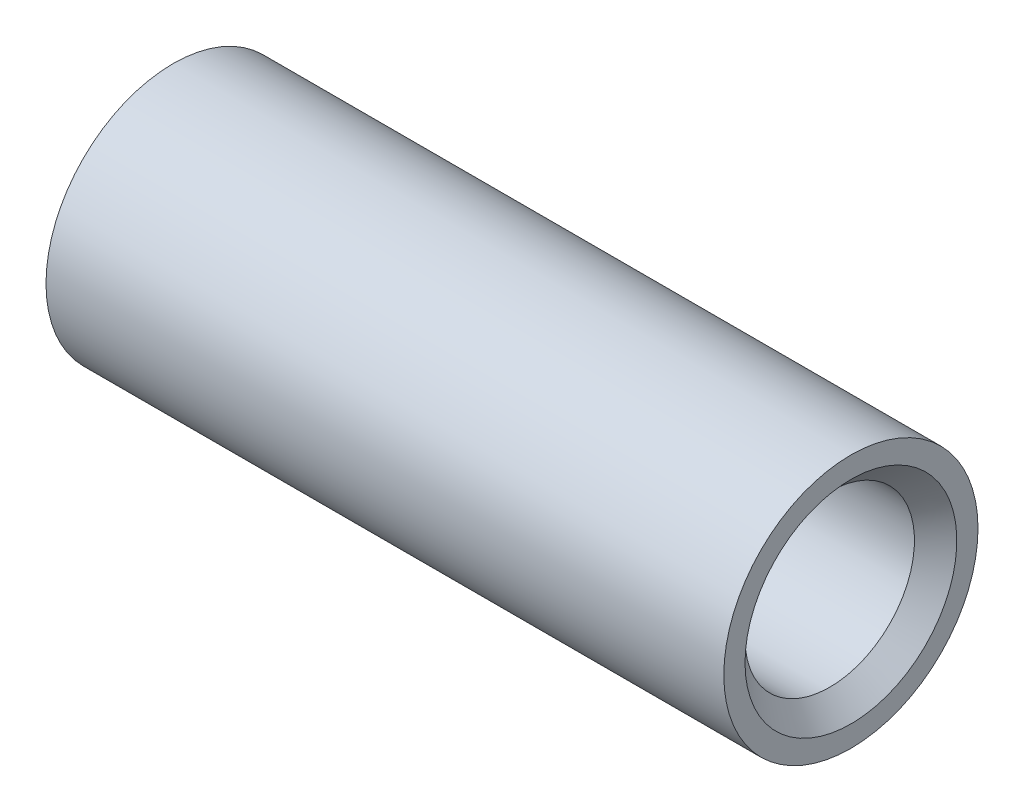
ISO-10303-21;
HEADER;
FILE_DESCRIPTION(('STEP AP214'),'2;1');
FILE_NAME('part.step','',(''),(''),'','','');
FILE_SCHEMA(('AUTOMOTIVE_DESIGN { 1 0 10303 214 1 1 1 1 }'));
ENDSEC;
DATA;
#1=APPLICATION_CONTEXT('core data for automotive mechanical design processes');
#2=APPLICATION_PROTOCOL_DEFINITION('international standard','automotive_design',2000,#1);
#3=PRODUCT_CONTEXT('',#1,'mechanical');
#4=PRODUCT('Part','Part','',(#3));
#5=PRODUCT_RELATED_PRODUCT_CATEGORY('part','',(#4));
#6=PRODUCT_DEFINITION_FORMATION('','',#4);
#7=PRODUCT_DEFINITION_CONTEXT('part definition',#1,'design');
#8=PRODUCT_DEFINITION('design','',#6,#7);
#9=PRODUCT_DEFINITION_SHAPE('','',#8);
#10=(LENGTH_UNIT() NAMED_UNIT(*) SI_UNIT(.MILLI.,.METRE.));
#11=(NAMED_UNIT(*) PLANE_ANGLE_UNIT() SI_UNIT($,.RADIAN.));
#12=(NAMED_UNIT(*) SI_UNIT($,.STERADIAN.) SOLID_ANGLE_UNIT());
#13=UNCERTAINTY_MEASURE_WITH_UNIT(LENGTH_MEASURE(1.E-05),#10,'distance_accuracy_value','');
#14=(GEOMETRIC_REPRESENTATION_CONTEXT(3) GLOBAL_UNCERTAINTY_ASSIGNED_CONTEXT((#13)) GLOBAL_UNIT_ASSIGNED_CONTEXT((#10,
#11,#12)) REPRESENTATION_CONTEXT('',''));
#15=CARTESIAN_POINT('',(0.,0.,0.));
#16=DIRECTION('',(0.,0.,1.));
#17=DIRECTION('',(1.,0.,0.));
#18=AXIS2_PLACEMENT_3D('',#15,#16,#17);
#19=CARTESIAN_POINT('',(-16.,4.,0.));
#20=DIRECTION('',(1.,0.,0.));
#21=DIRECTION('',(0.,0.,-1.));
#22=AXIS2_PLACEMENT_3D('',#19,#20,#21);
#23=PLANE('',#22);
#24=CARTESIAN_POINT('',(-16.,0.,0.));
#25=DIRECTION('',(1.,0.,0.));
#26=DIRECTION('',(0.,0.,-1.));
#27=AXIS2_PLACEMENT_3D('',#24,#25,#26);
#28=CIRCLE('',#27,5.);
#29=CARTESIAN_POINT('',(-16.,0.,-5.));
#30=VERTEX_POINT('',#29);
#31=EDGE_CURVE('E42',#30,#30,#28,.T.);
#32=ORIENTED_EDGE('',*,*,#31,.T.);
#33=EDGE_LOOP('',(#32));
#34=FACE_BOUND('',#33,.T.);
#35=CARTESIAN_POINT('',(-16.,0.,0.));
#36=DIRECTION('',(-1.,0.,0.));
#37=DIRECTION('',(0.,0.,1.));
#38=AXIS2_PLACEMENT_3D('',#35,#36,#37);
#39=CIRCLE('',#38,6.);
#40=CARTESIAN_POINT('',(-16.,0.,6.));
#41=VERTEX_POINT('',#40);
#42=EDGE_CURVE('E55',#41,#41,#39,.T.);
#43=ORIENTED_EDGE('',*,*,#42,.T.);
#44=EDGE_LOOP('',(#43));
#45=FACE_BOUND('',#44,.T.);
#46=ADVANCED_FACE('F35',(#34,#45),#23,.F.);
#47=CARTESIAN_POINT('',(-63.7762275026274,0.,0.));
#48=DIRECTION('',(-1.,0.,0.));
#49=DIRECTION('',(0.,0.,1.));
#50=AXIS2_PLACEMENT_3D('',#47,#48,#49);
#51=CYLINDRICAL_SURFACE('',#50,6.);
#52=ORIENTED_EDGE('',*,*,#42,.F.);
#53=EDGE_LOOP('',(#52));
#54=FACE_BOUND('',#53,.T.);
#55=CARTESIAN_POINT('',(16.,0.,0.));
#56=DIRECTION('',(-1.,0.,0.));
#57=DIRECTION('',(0.,0.,1.));
#58=AXIS2_PLACEMENT_3D('',#55,#56,#57);
#59=CIRCLE('',#58,6.);
#60=CARTESIAN_POINT('',(16.,0.,6.));
#61=VERTEX_POINT('',#60);
#62=EDGE_CURVE('E58',#61,#61,#59,.T.);
#63=ORIENTED_EDGE('',*,*,#62,.T.);
#64=EDGE_LOOP('',(#63));
#65=FACE_BOUND('',#64,.T.);
#66=ADVANCED_FACE('F62',(#54,#65),#51,.T.);
#67=CARTESIAN_POINT('',(16.,4.,0.));
#68=DIRECTION('',(-1.,0.,0.));
#69=DIRECTION('',(0.,0.,1.));
#70=AXIS2_PLACEMENT_3D('',#67,#68,#69);
#71=PLANE('',#70);
#72=CARTESIAN_POINT('',(16.,0.,0.));
#73=DIRECTION('',(-1.,0.,0.));
#74=DIRECTION('',(0.,0.,1.));
#75=AXIS2_PLACEMENT_3D('',#72,#73,#74);
#76=CIRCLE('',#75,4.99999999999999);
#77=CARTESIAN_POINT('',(16.,0.,4.99999999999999));
#78=VERTEX_POINT('',#77);
#79=EDGE_CURVE('E10',#78,#78,#76,.T.);
#80=ORIENTED_EDGE('',*,*,#79,.T.);
#81=EDGE_LOOP('',(#80));
#82=FACE_BOUND('',#81,.T.);
#83=ORIENTED_EDGE('',*,*,#62,.F.);
#84=EDGE_LOOP('',(#83));
#85=FACE_BOUND('',#84,.T.);
#86=ADVANCED_FACE('F64',(#82,#85),#71,.F.);
#87=CARTESIAN_POINT('',(-63.7762275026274,0.,0.));
#88=DIRECTION('',(-1.,0.,0.));
#89=DIRECTION('',(0.,0.,1.));
#90=AXIS2_PLACEMENT_3D('',#87,#88,#89);
#91=CYLINDRICAL_SURFACE('',#90,4.);
#92=CARTESIAN_POINT('',(-15.,0.,0.));
#93=DIRECTION('',(1.,0.,0.));
#94=DIRECTION('',(0.,0.,-1.));
#95=AXIS2_PLACEMENT_3D('',#92,#93,#94);
#96=CIRCLE('',#95,4.);
#97=CARTESIAN_POINT('',(-15.,0.,-4.));
#98=VERTEX_POINT('',#97);
#99=EDGE_CURVE('E46',#98,#98,#96,.F.);
#100=ORIENTED_EDGE('',*,*,#99,.T.);
#101=EDGE_LOOP('',(#100));
#102=FACE_BOUND('',#101,.T.);
#103=CARTESIAN_POINT('',(15.,0.,0.));
#104=DIRECTION('',(-1.,0.,0.));
#105=DIRECTION('',(0.,0.,1.));
#106=AXIS2_PLACEMENT_3D('',#103,#104,#105);
#107=CIRCLE('',#106,4.);
#108=CARTESIAN_POINT('',(15.,0.,4.));
#109=VERTEX_POINT('',#108);
#110=EDGE_CURVE('E50',#109,#109,#107,.F.);
#111=ORIENTED_EDGE('',*,*,#110,.T.);
#112=EDGE_LOOP('',(#111));
#113=FACE_BOUND('',#112,.T.);
#114=ADVANCED_FACE('F66',(#102,#113),#91,.F.);
#115=CARTESIAN_POINT('',(-15.,0.,0.));
#116=DIRECTION('',(-1.,0.,0.));
#117=DIRECTION('',(0.,0.,1.));
#118=AXIS2_PLACEMENT_3D('',#115,#116,#117);
#119=CONICAL_SURFACE('',#118,4.,0.785398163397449);
#120=ORIENTED_EDGE('',*,*,#31,.F.);
#121=EDGE_LOOP('',(#120));
#122=FACE_BOUND('',#121,.T.);
#123=ORIENTED_EDGE('',*,*,#99,.F.);
#124=EDGE_LOOP('',(#123));
#125=FACE_BOUND('',#124,.T.);
#126=ADVANCED_FACE('F72',(#122,#125),#119,.F.);
#127=CARTESIAN_POINT('',(16.,0.,0.));
#128=DIRECTION('',(1.,0.,0.));
#129=DIRECTION('',(0.,0.,-1.));
#130=AXIS2_PLACEMENT_3D('',#127,#128,#129);
#131=CONICAL_SURFACE('',#130,5.,0.785398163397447);
#132=ORIENTED_EDGE('',*,*,#110,.F.);
#133=EDGE_LOOP('',(#132));
#134=FACE_BOUND('',#133,.T.);
#135=ORIENTED_EDGE('',*,*,#79,.F.);
#136=EDGE_LOOP('',(#135));
#137=FACE_BOUND('',#136,.T.);
#138=ADVANCED_FACE('F37',(#134,#137),#131,.F.);
#139=CLOSED_SHELL('',(#46,#66,#86,#114,#126,#138));
#140=MANIFOLD_SOLID_BREP('B2',#139);
#141=ADVANCED_BREP_SHAPE_REPRESENTATION('',(#18,#140),#14);
#142=SHAPE_DEFINITION_REPRESENTATION(#9,#141);
ENDSEC;
END-ISO-10303-21;
